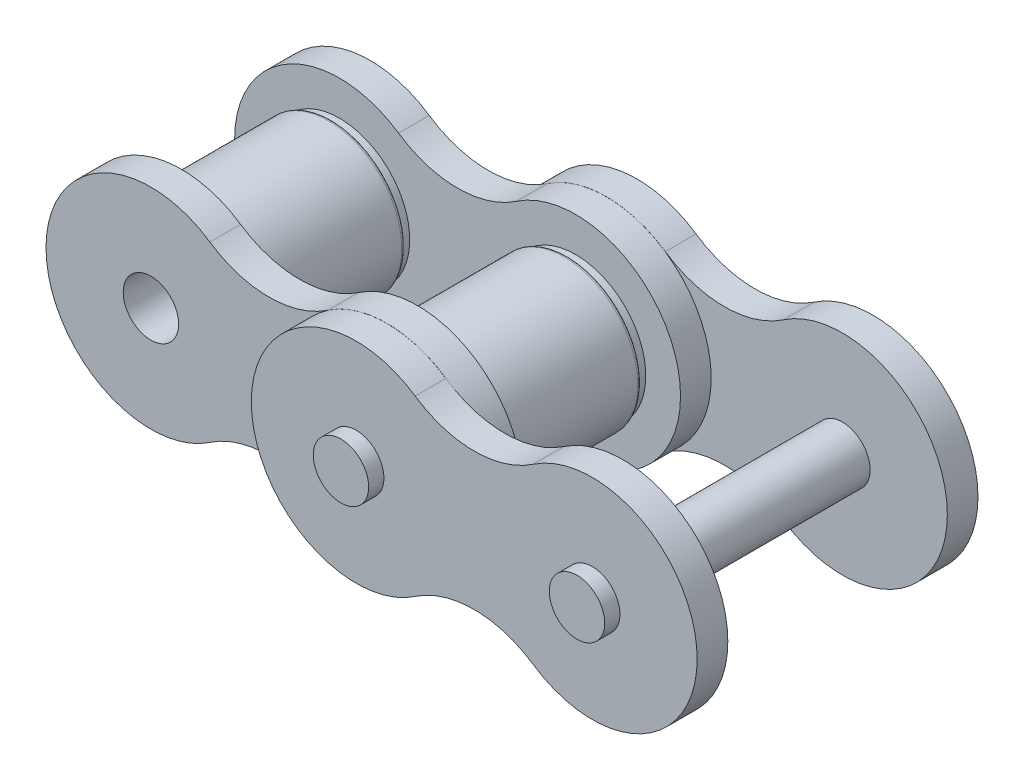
ISO-10303-21;
HEADER;
FILE_DESCRIPTION(('STEP AP214'),'2;1');
FILE_NAME('part.step','',(''),(''),'','','');
FILE_SCHEMA(('AUTOMOTIVE_DESIGN { 1 0 10303 214 1 1 1 1 }'));
ENDSEC;
DATA;
#1=APPLICATION_CONTEXT('core data for automotive mechanical design processes');
#2=APPLICATION_PROTOCOL_DEFINITION('international standard','automotive_design',2000,#1);
#3=PRODUCT_CONTEXT('',#1,'mechanical');
#4=PRODUCT('Part','Part','',(#3));
#5=PRODUCT_RELATED_PRODUCT_CATEGORY('part','',(#4));
#6=PRODUCT_DEFINITION_FORMATION('','',#4);
#7=PRODUCT_DEFINITION_CONTEXT('part definition',#1,'design');
#8=PRODUCT_DEFINITION('design','',#6,#7);
#9=PRODUCT_DEFINITION_SHAPE('','',#8);
#10=(LENGTH_UNIT() NAMED_UNIT(*) SI_UNIT(.MILLI.,.METRE.));
#11=(NAMED_UNIT(*) PLANE_ANGLE_UNIT() SI_UNIT($,.RADIAN.));
#12=(NAMED_UNIT(*) SI_UNIT($,.STERADIAN.) SOLID_ANGLE_UNIT());
#13=UNCERTAINTY_MEASURE_WITH_UNIT(LENGTH_MEASURE(1.E-05),#10,'distance_accuracy_value','');
#14=(GEOMETRIC_REPRESENTATION_CONTEXT(3) GLOBAL_UNCERTAINTY_ASSIGNED_CONTEXT((#13)) GLOBAL_UNIT_ASSIGNED_CONTEXT((#10,
#11,#12)) REPRESENTATION_CONTEXT('',''));
#15=CARTESIAN_POINT('',(0.,0.,0.));
#16=DIRECTION('',(0.,0.,1.));
#17=DIRECTION('',(1.,0.,0.));
#18=AXIS2_PLACEMENT_3D('',#15,#16,#17);
#19=CARTESIAN_POINT('',(25.4,0.,-7.24999999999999));
#20=DIRECTION('',(0.,0.,1.));
#21=DIRECTION('',(-1.,0.,0.));
#22=AXIS2_PLACEMENT_3D('',#19,#20,#21);
#23=TOROIDAL_SURFACE('',#22,7.54999999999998,0.400000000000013);
#24=CARTESIAN_POINT('',(25.4,0.,-7.65));
#25=DIRECTION('',(0.,0.,-1.));
#26=DIRECTION('',(-1.,0.,0.));
#27=AXIS2_PLACEMENT_3D('',#24,#25,#26);
#28=CIRCLE('',#27,7.55);
#29=CARTESIAN_POINT('',(17.85,0.,-7.65));
#30=VERTEX_POINT('',#29);
#31=EDGE_CURVE('E178',#30,#30,#28,.T.);
#32=ORIENTED_EDGE('',*,*,#31,.F.);
#33=EDGE_LOOP('',(#32));
#34=FACE_BOUND('',#33,.T.);
#35=CARTESIAN_POINT('',(25.4,0.,-7.25));
#36=DIRECTION('',(0.,0.,-1.));
#37=DIRECTION('',(-1.,0.,0.));
#38=AXIS2_PLACEMENT_3D('',#35,#36,#37);
#39=CIRCLE('',#38,7.95);
#40=CARTESIAN_POINT('',(17.45,0.,-7.25));
#41=VERTEX_POINT('',#40);
#42=EDGE_CURVE('E175',#41,#41,#39,.F.);
#43=ORIENTED_EDGE('',*,*,#42,.F.);
#44=EDGE_LOOP('',(#43));
#45=FACE_BOUND('',#44,.T.);
#46=ADVANCED_FACE('F15',(#34,#45),#23,.T.);
#47=CARTESIAN_POINT('',(0.,0.,-7.25));
#48=DIRECTION('',(0.,0.,1.));
#49=DIRECTION('',(-1.,0.,0.));
#50=AXIS2_PLACEMENT_3D('',#47,#48,#49);
#51=TOROIDAL_SURFACE('',#50,7.55,0.399999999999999);
#52=CARTESIAN_POINT('',(0.,0.,-7.65));
#53=DIRECTION('',(0.,0.,-1.));
#54=DIRECTION('',(-1.,0.,0.));
#55=AXIS2_PLACEMENT_3D('',#52,#53,#54);
#56=CIRCLE('',#55,7.55);
#57=CARTESIAN_POINT('',(-7.55,0.,-7.65));
#58=VERTEX_POINT('',#57);
#59=EDGE_CURVE('E181',#58,#58,#56,.T.);
#60=ORIENTED_EDGE('',*,*,#59,.F.);
#61=EDGE_LOOP('',(#60));
#62=FACE_BOUND('',#61,.T.);
#63=CARTESIAN_POINT('',(0.,0.,-7.25));
#64=DIRECTION('',(0.,0.,-1.));
#65=DIRECTION('',(-1.,0.,0.));
#66=AXIS2_PLACEMENT_3D('',#63,#64,#65);
#67=CIRCLE('',#66,7.95);
#68=CARTESIAN_POINT('',(-7.95,0.,-7.25));
#69=VERTEX_POINT('',#68);
#70=EDGE_CURVE('E172',#69,#69,#67,.F.);
#71=ORIENTED_EDGE('',*,*,#70,.F.);
#72=EDGE_LOOP('',(#71));
#73=FACE_BOUND('',#72,.T.);
#74=ADVANCED_FACE('F715',(#62,#73),#51,.T.);
#75=CARTESIAN_POINT('',(0.,0.,-8.075));
#76=DIRECTION('',(0.,0.,-1.));
#77=DIRECTION('',(-1.,0.,0.));
#78=AXIS2_PLACEMENT_3D('',#75,#76,#77);
#79=CYLINDRICAL_SURFACE('',#78,7.55);
#80=CARTESIAN_POINT('',(0.,0.,-8.5));
#81=DIRECTION('',(0.,0.,-1.));
#82=DIRECTION('',(-1.,0.,0.));
#83=AXIS2_PLACEMENT_3D('',#80,#81,#82);
#84=CIRCLE('',#83,7.55);
#85=CARTESIAN_POINT('',(-7.55,0.,-8.5));
#86=VERTEX_POINT('',#85);
#87=EDGE_CURVE('E19',#86,#86,#84,.F.);
#88=ORIENTED_EDGE('',*,*,#87,.T.);
#89=EDGE_LOOP('',(#88));
#90=FACE_BOUND('',#89,.T.);
#91=ORIENTED_EDGE('',*,*,#59,.T.);
#92=EDGE_LOOP('',(#91));
#93=FACE_BOUND('',#92,.T.);
#94=ADVANCED_FACE('F317',(#90,#93),#79,.T.);
#95=CARTESIAN_POINT('',(25.4,0.,-8.075));
#96=DIRECTION('',(0.,0.,-1.));
#97=DIRECTION('',(-1.,0.,0.));
#98=AXIS2_PLACEMENT_3D('',#95,#96,#97);
#99=CYLINDRICAL_SURFACE('',#98,7.55);
#100=ORIENTED_EDGE('',*,*,#31,.T.);
#101=EDGE_LOOP('',(#100));
#102=FACE_BOUND('',#101,.T.);
#103=CARTESIAN_POINT('',(25.4,0.,-8.5));
#104=DIRECTION('',(0.,0.,-1.));
#105=DIRECTION('',(-1.,0.,0.));
#106=AXIS2_PLACEMENT_3D('',#103,#104,#105);
#107=CIRCLE('',#106,7.55);
#108=CARTESIAN_POINT('',(17.85,0.,-8.5));
#109=VERTEX_POINT('',#108);
#110=EDGE_CURVE('E171',#109,#109,#107,.F.);
#111=ORIENTED_EDGE('',*,*,#110,.T.);
#112=EDGE_LOOP('',(#111));
#113=FACE_BOUND('',#112,.T.);
#114=ADVANCED_FACE('F700',(#102,#113),#99,.T.);
#115=CARTESIAN_POINT('',(25.4,0.,0.));
#116=DIRECTION('',(0.,0.,-1.));
#117=DIRECTION('',(-1.,0.,0.));
#118=AXIS2_PLACEMENT_3D('',#115,#116,#117);
#119=CYLINDRICAL_SURFACE('',#118,7.95);
#120=CARTESIAN_POINT('',(25.4,0.,7.24999999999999));
#121=DIRECTION('',(0.,0.,1.));
#122=DIRECTION('',(-1.,0.,0.));
#123=AXIS2_PLACEMENT_3D('',#120,#121,#122);
#124=CIRCLE('',#123,7.94999999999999);
#125=CARTESIAN_POINT('',(17.45,0.,7.24999999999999));
#126=VERTEX_POINT('',#125);
#127=EDGE_CURVE('E168',#126,#126,#124,.T.);
#128=ORIENTED_EDGE('',*,*,#127,.F.);
#129=EDGE_LOOP('',(#128));
#130=FACE_BOUND('',#129,.T.);
#131=ORIENTED_EDGE('',*,*,#42,.T.);
#132=EDGE_LOOP('',(#131));
#133=FACE_BOUND('',#132,.T.);
#134=ADVANCED_FACE('F692',(#130,#133),#119,.T.);
#135=CARTESIAN_POINT('',(0.,0.,0.));
#136=DIRECTION('',(0.,0.,-1.));
#137=DIRECTION('',(-1.,0.,0.));
#138=AXIS2_PLACEMENT_3D('',#135,#136,#137);
#139=CYLINDRICAL_SURFACE('',#138,7.95);
#140=CARTESIAN_POINT('',(0.,0.,7.25));
#141=DIRECTION('',(0.,0.,1.));
#142=DIRECTION('',(-1.,0.,0.));
#143=AXIS2_PLACEMENT_3D('',#140,#141,#142);
#144=CIRCLE('',#143,7.95);
#145=CARTESIAN_POINT('',(-7.95,0.,7.25));
#146=VERTEX_POINT('',#145);
#147=EDGE_CURVE('E164',#146,#146,#144,.T.);
#148=ORIENTED_EDGE('',*,*,#147,.F.);
#149=EDGE_LOOP('',(#148));
#150=FACE_BOUND('',#149,.T.);
#151=ORIENTED_EDGE('',*,*,#70,.T.);
#152=EDGE_LOOP('',(#151));
#153=FACE_BOUND('',#152,.T.);
#154=ADVANCED_FACE('F684',(#150,#153),#139,.T.);
#155=CARTESIAN_POINT('',(52.290625,0.,-16.75));
#156=DIRECTION('',(0.,0.,-1.));
#157=DIRECTION('',(-1.,0.,0.));
#158=AXIS2_PLACEMENT_3D('',#155,#156,#157);
#159=PLANE('',#158);
#160=CARTESIAN_POINT('',(50.8,0.,-16.75));
#161=DIRECTION('',(0.,0.,-1.));
#162=DIRECTION('',(-1.,0.,0.));
#163=AXIS2_PLACEMENT_3D('',#160,#161,#162);
#164=CIRCLE('',#163,2.98125);
#165=CARTESIAN_POINT('',(47.81875,0.,-16.75));
#166=VERTEX_POINT('',#165);
#167=EDGE_CURVE('E167',#166,#166,#164,.F.);
#168=ORIENTED_EDGE('',*,*,#167,.F.);
#169=EDGE_LOOP('',(#168));
#170=FACE_BOUND('',#169,.T.);
#171=ADVANCED_FACE('F332',(#170),#159,.T.);
#172=CARTESIAN_POINT('',(26.890625,0.,-16.75));
#173=DIRECTION('',(0.,0.,-1.));
#174=DIRECTION('',(-1.,0.,0.));
#175=AXIS2_PLACEMENT_3D('',#172,#173,#174);
#176=PLANE('',#175);
#177=CARTESIAN_POINT('',(25.4,0.,-16.75));
#178=DIRECTION('',(0.,0.,-1.));
#179=DIRECTION('',(-1.,0.,0.));
#180=AXIS2_PLACEMENT_3D('',#177,#178,#179);
#181=CIRCLE('',#180,2.98125);
#182=CARTESIAN_POINT('',(22.41875,0.,-16.75));
#183=VERTEX_POINT('',#182);
#184=EDGE_CURVE('E147',#183,#183,#181,.F.);
#185=ORIENTED_EDGE('',*,*,#184,.F.);
#186=EDGE_LOOP('',(#185));
#187=FACE_BOUND('',#186,.T.);
#188=ADVANCED_FACE('F321',(#187),#176,.T.);
#189=CARTESIAN_POINT('',(0.,0.,-8.5));
#190=DIRECTION('',(0.,0.,-1.));
#191=DIRECTION('',(-1.,0.,0.));
#192=AXIS2_PLACEMENT_3D('',#189,#190,#191);
#193=PLANE('',#192);
#194=ORIENTED_EDGE('',*,*,#110,.F.);
#195=EDGE_LOOP('',(#194));
#196=FACE_BOUND('',#195,.T.);
#197=CARTESIAN_POINT('',(12.7,-18.6675141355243,-8.5));
#198=DIRECTION('',(0.,0.,1.));
#199=DIRECTION('',(1.,0.,0.));
#200=AXIS2_PLACEMENT_3D('',#197,#198,#199);
#201=CIRCLE('',#200,11.289);
#202=CARTESIAN_POINT('',(6.35,-9.33375706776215,-8.5));
#203=VERTEX_POINT('',#202);
#204=CARTESIAN_POINT('',(19.05,-9.33375706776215,-8.5));
#205=VERTEX_POINT('',#204);
#206=EDGE_CURVE('E131',#203,#205,#201,.F.);
#207=ORIENTED_EDGE('',*,*,#206,.T.);
#208=CARTESIAN_POINT('',(25.4,0.,-8.5));
#209=DIRECTION('',(0.,0.,1.));
#210=DIRECTION('',(1.,0.,0.));
#211=AXIS2_PLACEMENT_3D('',#208,#209,#210);
#212=CIRCLE('',#211,11.289);
#213=CARTESIAN_POINT('',(19.05,9.33375706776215,-8.5));
#214=VERTEX_POINT('',#213);
#215=EDGE_CURVE('E304',#214,#205,#212,.F.);
#216=ORIENTED_EDGE('',*,*,#215,.F.);
#217=CARTESIAN_POINT('',(12.7,18.6675141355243,-8.5));
#218=DIRECTION('',(0.,0.,1.));
#219=DIRECTION('',(1.,0.,0.));
#220=AXIS2_PLACEMENT_3D('',#217,#218,#219);
#221=CIRCLE('',#220,11.289);
#222=CARTESIAN_POINT('',(6.34999999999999,9.33375706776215,-8.5));
#223=VERTEX_POINT('',#222);
#224=EDGE_CURVE('E134',#214,#223,#221,.F.);
#225=ORIENTED_EDGE('',*,*,#224,.T.);
#226=CARTESIAN_POINT('',(0.,0.,-8.5));
#227=DIRECTION('',(0.,0.,1.));
#228=DIRECTION('',(1.,0.,0.));
#229=AXIS2_PLACEMENT_3D('',#226,#227,#228);
#230=CIRCLE('',#229,11.289);
#231=EDGE_CURVE('E127',#203,#223,#230,.F.);
#232=ORIENTED_EDGE('',*,*,#231,.F.);
#233=EDGE_LOOP('',(#207,#216,#225,#232));
#234=FACE_BOUND('',#233,.T.);
#235=ORIENTED_EDGE('',*,*,#87,.F.);
#236=EDGE_LOOP('',(#235));
#237=FACE_BOUND('',#236,.T.);
#238=ADVANCED_FACE('F129',(#196,#234,#237),#193,.F.);
#239=CARTESIAN_POINT('',(25.4,0.,7.24999999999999));
#240=DIRECTION('',(0.,0.,1.));
#241=DIRECTION('',(-1.,0.,0.));
#242=AXIS2_PLACEMENT_3D('',#239,#240,#241);
#243=TOROIDAL_SURFACE('',#242,7.54999999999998,0.400000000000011);
#244=ORIENTED_EDGE('',*,*,#127,.T.);
#245=EDGE_LOOP('',(#244));
#246=FACE_BOUND('',#245,.T.);
#247=CARTESIAN_POINT('',(25.4,0.,7.65));
#248=DIRECTION('',(0.,0.,-1.));
#249=DIRECTION('',(-1.,0.,0.));
#250=AXIS2_PLACEMENT_3D('',#247,#248,#249);
#251=CIRCLE('',#250,7.54999999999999);
#252=CARTESIAN_POINT('',(17.85,0.,7.65));
#253=VERTEX_POINT('',#252);
#254=EDGE_CURVE('E161',#253,#253,#251,.F.);
#255=ORIENTED_EDGE('',*,*,#254,.F.);
#256=EDGE_LOOP('',(#255));
#257=FACE_BOUND('',#256,.T.);
#258=ADVANCED_FACE('F320',(#246,#257),#243,.T.);
#259=CARTESIAN_POINT('',(0.,0.,7.25));
#260=DIRECTION('',(0.,0.,1.));
#261=DIRECTION('',(-1.,0.,0.));
#262=AXIS2_PLACEMENT_3D('',#259,#260,#261);
#263=TOROIDAL_SURFACE('',#262,7.55,0.399999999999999);
#264=ORIENTED_EDGE('',*,*,#147,.T.);
#265=EDGE_LOOP('',(#264));
#266=FACE_BOUND('',#265,.T.);
#267=CARTESIAN_POINT('',(0.,0.,7.65));
#268=DIRECTION('',(0.,0.,-1.));
#269=DIRECTION('',(-1.,0.,0.));
#270=AXIS2_PLACEMENT_3D('',#267,#268,#269);
#271=CIRCLE('',#270,7.55);
#272=CARTESIAN_POINT('',(-7.55,0.,7.65));
#273=VERTEX_POINT('',#272);
#274=EDGE_CURVE('E157',#273,#273,#271,.F.);
#275=ORIENTED_EDGE('',*,*,#274,.F.);
#276=EDGE_LOOP('',(#275));
#277=FACE_BOUND('',#276,.T.);
#278=ADVANCED_FACE('F329',(#266,#277),#263,.T.);
#279=CARTESIAN_POINT('',(50.8,0.,0.));
#280=DIRECTION('',(0.,0.,-1.));
#281=DIRECTION('',(-1.,0.,0.));
#282=AXIS2_PLACEMENT_3D('',#279,#280,#281);
#283=CYLINDRICAL_SURFACE('',#282,2.98125);
#284=ORIENTED_EDGE('',*,*,#167,.T.);
#285=EDGE_LOOP('',(#284));
#286=FACE_BOUND('',#285,.T.);
#287=CARTESIAN_POINT('',(50.8,0.,-15.11));
#288=DIRECTION('',(0.,0.,-1.));
#289=DIRECTION('',(-1.,0.,0.));
#290=AXIS2_PLACEMENT_3D('',#287,#288,#289);
#291=CIRCLE('',#290,2.98125);
#292=CARTESIAN_POINT('',(47.81875,0.,-15.11));
#293=VERTEX_POINT('',#292);
#294=EDGE_CURVE('E160',#293,#293,#291,.F.);
#295=ORIENTED_EDGE('',*,*,#294,.F.);
#296=EDGE_LOOP('',(#295));
#297=FACE_BOUND('',#296,.T.);
#298=ADVANCED_FACE('F652',(#286,#297),#283,.T.);
#299=CARTESIAN_POINT('',(25.4,0.,-12.625));
#300=DIRECTION('',(0.,0.,-1.));
#301=DIRECTION('',(-1.,0.,0.));
#302=AXIS2_PLACEMENT_3D('',#299,#300,#301);
#303=CYLINDRICAL_SURFACE('',#302,2.98125);
#304=CARTESIAN_POINT('',(25.4,0.,-15.11));
#305=DIRECTION('',(0.,0.,-1.));
#306=DIRECTION('',(-1.,0.,0.));
#307=AXIS2_PLACEMENT_3D('',#304,#305,#306);
#308=CIRCLE('',#307,2.98125);
#309=CARTESIAN_POINT('',(22.41875,0.,-15.11));
#310=VERTEX_POINT('',#309);
#311=EDGE_CURVE('E299',#310,#310,#308,.F.);
#312=ORIENTED_EDGE('',*,*,#311,.F.);
#313=EDGE_LOOP('',(#312));
#314=FACE_BOUND('',#313,.T.);
#315=ORIENTED_EDGE('',*,*,#184,.T.);
#316=EDGE_LOOP('',(#315));
#317=FACE_BOUND('',#316,.T.);
#318=ADVANCED_FACE('F645',(#314,#317),#303,.T.);
#319=CARTESIAN_POINT('',(12.7,-18.6675141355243,-8.5));
#320=DIRECTION('',(0.,0.,1.));
#321=DIRECTION('',(1.,0.,0.));
#322=AXIS2_PLACEMENT_3D('',#319,#320,#321);
#323=CYLINDRICAL_SURFACE('',#322,11.289);
#324=DIRECTION('',(0.,0.,1.));
#325=VECTOR('',#324,1.);
#326=CARTESIAN_POINT('',(19.05,-9.33375706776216,-8.5));
#327=LINE('',#326,#325);
#328=CARTESIAN_POINT('',(19.05,-9.33375706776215,-11.8));
#329=VERTEX_POINT('',#328);
#330=EDGE_CURVE('E145',#205,#329,#327,.F.);
#331=ORIENTED_EDGE('',*,*,#330,.F.);
#332=ORIENTED_EDGE('',*,*,#206,.F.);
#333=DIRECTION('',(0.,0.,1.));
#334=VECTOR('',#333,1.);
#335=CARTESIAN_POINT('',(6.34999999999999,-9.33375706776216,-8.5));
#336=LINE('',#335,#334);
#337=CARTESIAN_POINT('',(6.35,-9.33375706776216,-11.8));
#338=VERTEX_POINT('',#337);
#339=EDGE_CURVE('E138',#338,#203,#336,.T.);
#340=ORIENTED_EDGE('',*,*,#339,.F.);
#341=CARTESIAN_POINT('',(12.7,-18.6675141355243,-11.8));
#342=DIRECTION('',(0.,0.,1.));
#343=DIRECTION('',(1.,0.,0.));
#344=AXIS2_PLACEMENT_3D('',#341,#342,#343);
#345=CIRCLE('',#344,11.289);
#346=EDGE_CURVE('E297',#329,#338,#345,.T.);
#347=ORIENTED_EDGE('',*,*,#346,.F.);
#348=EDGE_LOOP('',(#331,#332,#340,#347));
#349=FACE_BOUND('',#348,.T.);
#350=ADVANCED_FACE('F142',(#349),#323,.F.);
#351=CARTESIAN_POINT('',(0.,0.,-8.5));
#352=DIRECTION('',(0.,0.,1.));
#353=DIRECTION('',(1.,0.,0.));
#354=AXIS2_PLACEMENT_3D('',#351,#352,#353);
#355=CYLINDRICAL_SURFACE('',#354,11.289);
#356=DIRECTION('',(0.,0.,1.));
#357=VECTOR('',#356,1.);
#358=CARTESIAN_POINT('',(6.34999999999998,9.33375706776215,-8.5));
#359=LINE('',#358,#357);
#360=CARTESIAN_POINT('',(6.34999999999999,9.33375706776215,-11.8));
#361=VERTEX_POINT('',#360);
#362=EDGE_CURVE('E155',#223,#361,#359,.F.);
#363=ORIENTED_EDGE('',*,*,#362,.T.);
#364=CARTESIAN_POINT('',(0.,0.,-11.8));
#365=DIRECTION('',(0.,0.,1.));
#366=DIRECTION('',(1.,0.,0.));
#367=AXIS2_PLACEMENT_3D('',#364,#365,#366);
#368=CIRCLE('',#367,11.289);
#369=EDGE_CURVE('E151',#338,#361,#368,.F.);
#370=ORIENTED_EDGE('',*,*,#369,.F.);
#371=ORIENTED_EDGE('',*,*,#339,.T.);
#372=ORIENTED_EDGE('',*,*,#231,.T.);
#373=EDGE_LOOP('',(#363,#370,#371,#372));
#374=FACE_BOUND('',#373,.T.);
#375=ADVANCED_FACE('F149',(#374),#355,.T.);
#376=CARTESIAN_POINT('',(12.7,18.6675141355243,-8.5));
#377=DIRECTION('',(0.,0.,1.));
#378=DIRECTION('',(1.,0.,0.));
#379=AXIS2_PLACEMENT_3D('',#376,#377,#378);
#380=CYLINDRICAL_SURFACE('',#379,11.289);
#381=ORIENTED_EDGE('',*,*,#362,.F.);
#382=ORIENTED_EDGE('',*,*,#224,.F.);
#383=DIRECTION('',(0.,0.,1.));
#384=VECTOR('',#383,1.);
#385=CARTESIAN_POINT('',(19.05,9.33375706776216,-8.5));
#386=LINE('',#385,#384);
#387=CARTESIAN_POINT('',(19.05,9.33375706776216,-11.8));
#388=VERTEX_POINT('',#387);
#389=EDGE_CURVE('E306',#388,#214,#386,.T.);
#390=ORIENTED_EDGE('',*,*,#389,.F.);
#391=CARTESIAN_POINT('',(12.7,18.6675141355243,-11.8));
#392=DIRECTION('',(0.,0.,1.));
#393=DIRECTION('',(1.,0.,0.));
#394=AXIS2_PLACEMENT_3D('',#391,#392,#393);
#395=CIRCLE('',#394,11.289);
#396=EDGE_CURVE('E293',#361,#388,#395,.T.);
#397=ORIENTED_EDGE('',*,*,#396,.F.);
#398=EDGE_LOOP('',(#381,#382,#390,#397));
#399=FACE_BOUND('',#398,.T.);
#400=ADVANCED_FACE('F415',(#399),#380,.F.);
#401=CARTESIAN_POINT('',(25.4,0.,-8.5));
#402=DIRECTION('',(0.,0.,1.));
#403=DIRECTION('',(1.,0.,0.));
#404=AXIS2_PLACEMENT_3D('',#401,#402,#403);
#405=CYLINDRICAL_SURFACE('',#404,11.289);
#406=ORIENTED_EDGE('',*,*,#330,.T.);
#407=CARTESIAN_POINT('',(25.4,0.,-11.8));
#408=DIRECTION('',(0.,0.,1.));
#409=DIRECTION('',(1.,0.,0.));
#410=AXIS2_PLACEMENT_3D('',#407,#408,#409);
#411=CIRCLE('',#410,11.289);
#412=EDGE_CURVE('E290',#388,#329,#411,.F.);
#413=ORIENTED_EDGE('',*,*,#412,.F.);
#414=ORIENTED_EDGE('',*,*,#389,.T.);
#415=ORIENTED_EDGE('',*,*,#215,.T.);
#416=EDGE_LOOP('',(#406,#413,#414,#415));
#417=FACE_BOUND('',#416,.T.);
#418=ADVANCED_FACE('F419',(#417),#405,.T.);
#419=CARTESIAN_POINT('',(25.4,0.,8.075));
#420=DIRECTION('',(0.,0.,-1.));
#421=DIRECTION('',(-1.,0.,0.));
#422=AXIS2_PLACEMENT_3D('',#419,#420,#421);
#423=CYLINDRICAL_SURFACE('',#422,7.54999999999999);
#424=CARTESIAN_POINT('',(25.4,0.,8.5));
#425=DIRECTION('',(0.,0.,-1.));
#426=DIRECTION('',(-1.,0.,0.));
#427=AXIS2_PLACEMENT_3D('',#424,#425,#426);
#428=CIRCLE('',#427,7.54999999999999);
#429=CARTESIAN_POINT('',(17.85,0.,8.5));
#430=VERTEX_POINT('',#429);
#431=EDGE_CURVE('E287',#430,#430,#428,.F.);
#432=ORIENTED_EDGE('',*,*,#431,.F.);
#433=EDGE_LOOP('',(#432));
#434=FACE_BOUND('',#433,.T.);
#435=ORIENTED_EDGE('',*,*,#254,.T.);
#436=EDGE_LOOP('',(#435));
#437=FACE_BOUND('',#436,.T.);
#438=ADVANCED_FACE('F421',(#434,#437),#423,.T.);
#439=CARTESIAN_POINT('',(0.,0.,8.075));
#440=DIRECTION('',(0.,0.,-1.));
#441=DIRECTION('',(-1.,0.,0.));
#442=AXIS2_PLACEMENT_3D('',#439,#440,#441);
#443=CYLINDRICAL_SURFACE('',#442,7.55);
#444=CARTESIAN_POINT('',(0.,0.,8.5));
#445=DIRECTION('',(0.,0.,-1.));
#446=DIRECTION('',(-1.,0.,0.));
#447=AXIS2_PLACEMENT_3D('',#444,#445,#446);
#448=CIRCLE('',#447,7.55);
#449=CARTESIAN_POINT('',(-7.55,0.,8.5));
#450=VERTEX_POINT('',#449);
#451=EDGE_CURVE('E284',#450,#450,#448,.F.);
#452=ORIENTED_EDGE('',*,*,#451,.F.);
#453=EDGE_LOOP('',(#452));
#454=FACE_BOUND('',#453,.T.);
#455=ORIENTED_EDGE('',*,*,#274,.T.);
#456=EDGE_LOOP('',(#455));
#457=FACE_BOUND('',#456,.T.);
#458=ADVANCED_FACE('F427',(#454,#457),#443,.T.);
#459=CARTESIAN_POINT('',(0.,0.,-15.11));
#460=DIRECTION('',(0.,0.,-1.));
#461=DIRECTION('',(-1.,0.,0.));
#462=AXIS2_PLACEMENT_3D('',#459,#460,#461);
#463=PLANE('',#462);
#464=ORIENTED_EDGE('',*,*,#311,.T.);
#465=EDGE_LOOP('',(#464));
#466=FACE_BOUND('',#465,.T.);
#467=CARTESIAN_POINT('',(38.1,18.6675141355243,-15.11));
#468=DIRECTION('',(0.,0.,1.));
#469=DIRECTION('',(1.,0.,0.));
#470=AXIS2_PLACEMENT_3D('',#467,#468,#469);
#471=CIRCLE('',#470,11.289);
#472=CARTESIAN_POINT('',(31.75,9.33375706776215,-15.11));
#473=VERTEX_POINT('',#472);
#474=CARTESIAN_POINT('',(44.45,9.33375706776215,-15.11));
#475=VERTEX_POINT('',#474);
#476=EDGE_CURVE('E280',#473,#475,#471,.T.);
#477=ORIENTED_EDGE('',*,*,#476,.T.);
#478=CARTESIAN_POINT('',(50.8,0.,-15.11));
#479=DIRECTION('',(0.,0.,1.));
#480=DIRECTION('',(1.,0.,0.));
#481=AXIS2_PLACEMENT_3D('',#478,#479,#480);
#482=CIRCLE('',#481,11.289);
#483=CARTESIAN_POINT('',(44.45,-9.33375706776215,-15.11));
#484=VERTEX_POINT('',#483);
#485=EDGE_CURVE('E277',#484,#475,#482,.T.);
#486=ORIENTED_EDGE('',*,*,#485,.F.);
#487=CARTESIAN_POINT('',(38.1,-18.6675141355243,-15.11));
#488=DIRECTION('',(0.,0.,1.));
#489=DIRECTION('',(1.,0.,0.));
#490=AXIS2_PLACEMENT_3D('',#487,#488,#489);
#491=CIRCLE('',#490,11.289);
#492=CARTESIAN_POINT('',(31.75,-9.33375706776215,-15.11));
#493=VERTEX_POINT('',#492);
#494=EDGE_CURVE('E274',#484,#493,#491,.T.);
#495=ORIENTED_EDGE('',*,*,#494,.T.);
#496=CARTESIAN_POINT('',(25.4,0.,-15.11));
#497=DIRECTION('',(0.,0.,1.));
#498=DIRECTION('',(1.,0.,0.));
#499=AXIS2_PLACEMENT_3D('',#496,#497,#498);
#500=CIRCLE('',#499,11.289);
#501=EDGE_CURVE('E271',#473,#493,#500,.T.);
#502=ORIENTED_EDGE('',*,*,#501,.F.);
#503=EDGE_LOOP('',(#477,#486,#495,#502));
#504=FACE_BOUND('',#503,.T.);
#505=ORIENTED_EDGE('',*,*,#294,.T.);
#506=EDGE_LOOP('',(#505));
#507=FACE_BOUND('',#506,.T.);
#508=ADVANCED_FACE('F435',(#466,#504,#507),#463,.T.);
#509=CARTESIAN_POINT('',(52.290625,0.,16.75));
#510=DIRECTION('',(0.,0.,1.));
#511=DIRECTION('',(1.,0.,0.));
#512=AXIS2_PLACEMENT_3D('',#509,#510,#511);
#513=PLANE('',#512);
#514=CARTESIAN_POINT('',(50.8,0.,16.75));
#515=DIRECTION('',(0.,0.,-1.));
#516=DIRECTION('',(-1.,0.,0.));
#517=AXIS2_PLACEMENT_3D('',#514,#515,#516);
#518=CIRCLE('',#517,2.98125);
#519=CARTESIAN_POINT('',(47.81875,0.,16.75));
#520=VERTEX_POINT('',#519);
#521=EDGE_CURVE('E264',#520,#520,#518,.T.);
#522=ORIENTED_EDGE('',*,*,#521,.F.);
#523=EDGE_LOOP('',(#522));
#524=FACE_BOUND('',#523,.T.);
#525=ADVANCED_FACE('F439',(#524),#513,.T.);
#526=CARTESIAN_POINT('',(26.890625,0.,16.75));
#527=DIRECTION('',(0.,0.,1.));
#528=DIRECTION('',(1.,0.,0.));
#529=AXIS2_PLACEMENT_3D('',#526,#527,#528);
#530=PLANE('',#529);
#531=CARTESIAN_POINT('',(25.4,0.,16.75));
#532=DIRECTION('',(0.,0.,-1.));
#533=DIRECTION('',(-1.,0.,0.));
#534=AXIS2_PLACEMENT_3D('',#531,#532,#533);
#535=CIRCLE('',#534,2.98125);
#536=CARTESIAN_POINT('',(22.41875,0.,16.75));
#537=VERTEX_POINT('',#536);
#538=EDGE_CURVE('E261',#537,#537,#535,.T.);
#539=ORIENTED_EDGE('',*,*,#538,.F.);
#540=EDGE_LOOP('',(#539));
#541=FACE_BOUND('',#540,.T.);
#542=ADVANCED_FACE('F443',(#541),#530,.T.);
#543=CARTESIAN_POINT('',(0.,0.,-11.8));
#544=DIRECTION('',(0.,0.,-1.));
#545=DIRECTION('',(-1.,0.,0.));
#546=AXIS2_PLACEMENT_3D('',#543,#544,#545);
#547=PLANE('',#546);
#548=ORIENTED_EDGE('',*,*,#396,.T.);
#549=ORIENTED_EDGE('',*,*,#412,.T.);
#550=ORIENTED_EDGE('',*,*,#346,.T.);
#551=ORIENTED_EDGE('',*,*,#369,.T.);
#552=EDGE_LOOP('',(#548,#549,#550,#551));
#553=FACE_BOUND('',#552,.T.);
#554=CARTESIAN_POINT('',(25.4,0.,-11.8));
#555=DIRECTION('',(0.,0.,-1.));
#556=DIRECTION('',(-1.,0.,0.));
#557=AXIS2_PLACEMENT_3D('',#554,#555,#556);
#558=CIRCLE('',#557,2.98125);
#559=CARTESIAN_POINT('',(22.41875,0.,-11.8));
#560=VERTEX_POINT('',#559);
#561=EDGE_CURVE('E267',#560,#560,#558,.T.);
#562=ORIENTED_EDGE('',*,*,#561,.F.);
#563=EDGE_LOOP('',(#562));
#564=FACE_BOUND('',#563,.T.);
#565=CARTESIAN_POINT('',(0.,0.,-11.8));
#566=DIRECTION('',(0.,0.,-1.));
#567=DIRECTION('',(-1.,0.,0.));
#568=AXIS2_PLACEMENT_3D('',#565,#566,#567);
#569=CIRCLE('',#568,2.98125);
#570=CARTESIAN_POINT('',(-2.98125,0.,-11.8));
#571=VERTEX_POINT('',#570);
#572=EDGE_CURVE('E258',#571,#571,#569,.F.);
#573=ORIENTED_EDGE('',*,*,#572,.T.);
#574=EDGE_LOOP('',(#573));
#575=FACE_BOUND('',#574,.T.);
#576=ADVANCED_FACE('F417',(#553,#564,#575),#547,.T.);
#577=CARTESIAN_POINT('',(0.,0.,8.5));
#578=DIRECTION('',(0.,0.,-1.));
#579=DIRECTION('',(-1.,0.,0.));
#580=AXIS2_PLACEMENT_3D('',#577,#578,#579);
#581=PLANE('',#580);
#582=ORIENTED_EDGE('',*,*,#451,.T.);
#583=EDGE_LOOP('',(#582));
#584=FACE_BOUND('',#583,.T.);
#585=CARTESIAN_POINT('',(25.4,0.,8.5));
#586=DIRECTION('',(0.,0.,-1.));
#587=DIRECTION('',(-1.,0.,0.));
#588=AXIS2_PLACEMENT_3D('',#585,#586,#587);
#589=CIRCLE('',#588,11.289);
#590=CARTESIAN_POINT('',(19.05,-9.33375706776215,8.5));
#591=VERTEX_POINT('',#590);
#592=CARTESIAN_POINT('',(19.05,9.33375706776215,8.5));
#593=VERTEX_POINT('',#592);
#594=EDGE_CURVE('E256',#591,#593,#589,.F.);
#595=ORIENTED_EDGE('',*,*,#594,.F.);
#596=CARTESIAN_POINT('',(12.7,-18.6675141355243,8.5));
#597=DIRECTION('',(0.,0.,-1.));
#598=DIRECTION('',(-1.,0.,0.));
#599=AXIS2_PLACEMENT_3D('',#596,#597,#598);
#600=CIRCLE('',#599,11.289);
#601=CARTESIAN_POINT('',(6.35,-9.33375706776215,8.5));
#602=VERTEX_POINT('',#601);
#603=EDGE_CURVE('E252',#591,#602,#600,.F.);
#604=ORIENTED_EDGE('',*,*,#603,.T.);
#605=CARTESIAN_POINT('',(0.,0.,8.5));
#606=DIRECTION('',(0.,0.,-1.));
#607=DIRECTION('',(-1.,0.,0.));
#608=AXIS2_PLACEMENT_3D('',#605,#606,#607);
#609=CIRCLE('',#608,11.289);
#610=CARTESIAN_POINT('',(6.34999999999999,9.33375706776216,8.5));
#611=VERTEX_POINT('',#610);
#612=EDGE_CURVE('E249',#611,#602,#609,.F.);
#613=ORIENTED_EDGE('',*,*,#612,.F.);
#614=CARTESIAN_POINT('',(12.7,18.6675141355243,8.5));
#615=DIRECTION('',(0.,0.,-1.));
#616=DIRECTION('',(-1.,0.,0.));
#617=AXIS2_PLACEMENT_3D('',#614,#615,#616);
#618=CIRCLE('',#617,11.289);
#619=EDGE_CURVE('E245',#611,#593,#618,.F.);
#620=ORIENTED_EDGE('',*,*,#619,.T.);
#621=EDGE_LOOP('',(#595,#604,#613,#620));
#622=FACE_BOUND('',#621,.T.);
#623=ORIENTED_EDGE('',*,*,#431,.T.);
#624=EDGE_LOOP('',(#623));
#625=FACE_BOUND('',#624,.T.);
#626=ADVANCED_FACE('F450',(#584,#622,#625),#581,.T.);
#627=CARTESIAN_POINT('',(38.1,18.6675141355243,-11.81));
#628=DIRECTION('',(0.,0.,1.));
#629=DIRECTION('',(1.,0.,0.));
#630=AXIS2_PLACEMENT_3D('',#627,#628,#629);
#631=CYLINDRICAL_SURFACE('',#630,11.289);
#632=DIRECTION('',(0.,0.,1.));
#633=VECTOR('',#632,1.);
#634=CARTESIAN_POINT('',(31.75,9.33375706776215,-11.81));
#635=LINE('',#634,#633);
#636=CARTESIAN_POINT('',(31.75,9.33375706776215,-11.81));
#637=VERTEX_POINT('',#636);
#638=EDGE_CURVE('E283',#637,#473,#635,.F.);
#639=ORIENTED_EDGE('',*,*,#638,.F.);
#640=CARTESIAN_POINT('',(38.1,18.6675141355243,-11.81));
#641=DIRECTION('',(0.,0.,1.));
#642=DIRECTION('',(1.,0.,0.));
#643=AXIS2_PLACEMENT_3D('',#640,#641,#642);
#644=CIRCLE('',#643,11.289);
#645=CARTESIAN_POINT('',(44.45,9.33375706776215,-11.81));
#646=VERTEX_POINT('',#645);
#647=EDGE_CURVE('E241',#637,#646,#644,.T.);
#648=ORIENTED_EDGE('',*,*,#647,.T.);
#649=DIRECTION('',(0.,0.,1.));
#650=VECTOR('',#649,1.);
#651=CARTESIAN_POINT('',(44.45,9.33375706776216,-11.81));
#652=LINE('',#651,#650);
#653=EDGE_CURVE('E279',#475,#646,#652,.T.);
#654=ORIENTED_EDGE('',*,*,#653,.F.);
#655=ORIENTED_EDGE('',*,*,#476,.F.);
#656=EDGE_LOOP('',(#639,#648,#654,#655));
#657=FACE_BOUND('',#656,.T.);
#658=ADVANCED_FACE('F453',(#657),#631,.F.);
#659=CARTESIAN_POINT('',(50.8,0.,-11.81));
#660=DIRECTION('',(0.,0.,1.));
#661=DIRECTION('',(1.,0.,0.));
#662=AXIS2_PLACEMENT_3D('',#659,#660,#661);
#663=CYLINDRICAL_SURFACE('',#662,11.289);
#664=DIRECTION('',(0.,0.,1.));
#665=VECTOR('',#664,1.);
#666=CARTESIAN_POINT('',(44.45,-9.33375706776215,-11.81));
#667=LINE('',#666,#665);
#668=CARTESIAN_POINT('',(44.45,-9.33375706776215,-11.81));
#669=VERTEX_POINT('',#668);
#670=EDGE_CURVE('E276',#669,#484,#667,.F.);
#671=ORIENTED_EDGE('',*,*,#670,.T.);
#672=ORIENTED_EDGE('',*,*,#485,.T.);
#673=ORIENTED_EDGE('',*,*,#653,.T.);
#674=CARTESIAN_POINT('',(50.8,0.,-11.81));
#675=DIRECTION('',(0.,0.,1.));
#676=DIRECTION('',(1.,0.,0.));
#677=AXIS2_PLACEMENT_3D('',#674,#675,#676);
#678=CIRCLE('',#677,11.289);
#679=EDGE_CURVE('E239',#646,#669,#678,.F.);
#680=ORIENTED_EDGE('',*,*,#679,.T.);
#681=EDGE_LOOP('',(#671,#672,#673,#680));
#682=FACE_BOUND('',#681,.T.);
#683=ADVANCED_FACE('F457',(#682),#663,.T.);
#684=CARTESIAN_POINT('',(38.1,-18.6675141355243,-11.81));
#685=DIRECTION('',(0.,0.,1.));
#686=DIRECTION('',(1.,0.,0.));
#687=AXIS2_PLACEMENT_3D('',#684,#685,#686);
#688=CYLINDRICAL_SURFACE('',#687,11.289);
#689=ORIENTED_EDGE('',*,*,#670,.F.);
#690=CARTESIAN_POINT('',(38.1,-18.6675141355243,-11.81));
#691=DIRECTION('',(0.,0.,1.));
#692=DIRECTION('',(1.,0.,0.));
#693=AXIS2_PLACEMENT_3D('',#690,#691,#692);
#694=CIRCLE('',#693,11.289);
#695=CARTESIAN_POINT('',(31.75,-9.33375706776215,-11.81));
#696=VERTEX_POINT('',#695);
#697=EDGE_CURVE('E237',#669,#696,#694,.T.);
#698=ORIENTED_EDGE('',*,*,#697,.T.);
#699=DIRECTION('',(0.,0.,1.));
#700=VECTOR('',#699,1.);
#701=CARTESIAN_POINT('',(31.75,-9.33375706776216,-11.81));
#702=LINE('',#701,#700);
#703=EDGE_CURVE('E270',#493,#696,#702,.T.);
#704=ORIENTED_EDGE('',*,*,#703,.F.);
#705=ORIENTED_EDGE('',*,*,#494,.F.);
#706=EDGE_LOOP('',(#689,#698,#704,#705));
#707=FACE_BOUND('',#706,.T.);
#708=ADVANCED_FACE('F461',(#707),#688,.F.);
#709=CARTESIAN_POINT('',(25.4,0.,-11.81));
#710=DIRECTION('',(0.,0.,1.));
#711=DIRECTION('',(1.,0.,0.));
#712=AXIS2_PLACEMENT_3D('',#709,#710,#711);
#713=CYLINDRICAL_SURFACE('',#712,11.289);
#714=ORIENTED_EDGE('',*,*,#703,.T.);
#715=CARTESIAN_POINT('',(25.4,0.,-11.81));
#716=DIRECTION('',(0.,0.,1.));
#717=DIRECTION('',(1.,0.,0.));
#718=AXIS2_PLACEMENT_3D('',#715,#716,#717);
#719=CIRCLE('',#718,11.289);
#720=EDGE_CURVE('E235',#696,#637,#719,.F.);
#721=ORIENTED_EDGE('',*,*,#720,.T.);
#722=ORIENTED_EDGE('',*,*,#638,.T.);
#723=ORIENTED_EDGE('',*,*,#501,.T.);
#724=EDGE_LOOP('',(#714,#721,#722,#723));
#725=FACE_BOUND('',#724,.T.);
#726=ADVANCED_FACE('F465',(#725),#713,.T.);
#727=CARTESIAN_POINT('',(25.4,0.,-12.625));
#728=DIRECTION('',(0.,0.,-1.));
#729=DIRECTION('',(-1.,0.,0.));
#730=AXIS2_PLACEMENT_3D('',#727,#728,#729);
#731=CYLINDRICAL_SURFACE('',#730,2.98125);
#732=ORIENTED_EDGE('',*,*,#561,.T.);
#733=EDGE_LOOP('',(#732));
#734=FACE_BOUND('',#733,.T.);
#735=CARTESIAN_POINT('',(25.4,0.,-11.81));
#736=DIRECTION('',(0.,0.,-1.));
#737=DIRECTION('',(-1.,0.,0.));
#738=AXIS2_PLACEMENT_3D('',#735,#736,#737);
#739=CIRCLE('',#738,2.98125);
#740=CARTESIAN_POINT('',(22.41875,0.,-11.81));
#741=VERTEX_POINT('',#740);
#742=EDGE_CURVE('E232',#741,#741,#739,.F.);
#743=ORIENTED_EDGE('',*,*,#742,.T.);
#744=EDGE_LOOP('',(#743));
#745=FACE_BOUND('',#744,.T.);
#746=ADVANCED_FACE('F469',(#734,#745),#731,.T.);
#747=CARTESIAN_POINT('',(50.8,0.,0.));
#748=DIRECTION('',(0.,0.,-1.));
#749=DIRECTION('',(-1.,0.,0.));
#750=AXIS2_PLACEMENT_3D('',#747,#748,#749);
#751=CYLINDRICAL_SURFACE('',#750,2.98125);
#752=CARTESIAN_POINT('',(50.8,0.,15.11));
#753=DIRECTION('',(0.,0.,-1.));
#754=DIRECTION('',(-1.,0.,0.));
#755=AXIS2_PLACEMENT_3D('',#752,#753,#754);
#756=CIRCLE('',#755,2.98125);
#757=CARTESIAN_POINT('',(47.81875,0.,15.11));
#758=VERTEX_POINT('',#757);
#759=EDGE_CURVE('E229',#758,#758,#756,.F.);
#760=ORIENTED_EDGE('',*,*,#759,.T.);
#761=EDGE_LOOP('',(#760));
#762=FACE_BOUND('',#761,.T.);
#763=ORIENTED_EDGE('',*,*,#521,.T.);
#764=EDGE_LOOP('',(#763));
#765=FACE_BOUND('',#764,.T.);
#766=ADVANCED_FACE('F473',(#762,#765),#751,.T.);
#767=CARTESIAN_POINT('',(25.4,0.,12.625));
#768=DIRECTION('',(0.,0.,-1.));
#769=DIRECTION('',(-1.,0.,0.));
#770=AXIS2_PLACEMENT_3D('',#767,#768,#769);
#771=CYLINDRICAL_SURFACE('',#770,2.98125);
#772=ORIENTED_EDGE('',*,*,#538,.T.);
#773=EDGE_LOOP('',(#772));
#774=FACE_BOUND('',#773,.T.);
#775=CARTESIAN_POINT('',(25.4,0.,15.11));
#776=DIRECTION('',(0.,0.,-1.));
#777=DIRECTION('',(-1.,0.,0.));
#778=AXIS2_PLACEMENT_3D('',#775,#776,#777);
#779=CIRCLE('',#778,2.98125);
#780=CARTESIAN_POINT('',(22.41875,0.,15.11));
#781=VERTEX_POINT('',#780);
#782=EDGE_CURVE('E226',#781,#781,#779,.F.);
#783=ORIENTED_EDGE('',*,*,#782,.T.);
#784=EDGE_LOOP('',(#783));
#785=FACE_BOUND('',#784,.T.);
#786=ADVANCED_FACE('F477',(#774,#785),#771,.T.);
#787=CARTESIAN_POINT('',(0.,0.,0.));
#788=DIRECTION('',(0.,0.,-1.));
#789=DIRECTION('',(-1.,0.,0.));
#790=AXIS2_PLACEMENT_3D('',#787,#788,#789);
#791=CYLINDRICAL_SURFACE('',#790,2.98125);
#792=CARTESIAN_POINT('',(0.,0.,11.8));
#793=DIRECTION('',(0.,0.,-1.));
#794=DIRECTION('',(-1.,0.,0.));
#795=AXIS2_PLACEMENT_3D('',#792,#793,#794);
#796=CIRCLE('',#795,2.98125);
#797=CARTESIAN_POINT('',(-2.98125,0.,11.8));
#798=VERTEX_POINT('',#797);
#799=EDGE_CURVE('E223',#798,#798,#796,.F.);
#800=ORIENTED_EDGE('',*,*,#799,.T.);
#801=EDGE_LOOP('',(#800));
#802=FACE_BOUND('',#801,.T.);
#803=ORIENTED_EDGE('',*,*,#572,.F.);
#804=EDGE_LOOP('',(#803));
#805=FACE_BOUND('',#804,.T.);
#806=ADVANCED_FACE('F481',(#802,#805),#791,.F.);
#807=CARTESIAN_POINT('',(25.4,0.,8.5));
#808=DIRECTION('',(0.,0.,-1.));
#809=DIRECTION('',(-1.,0.,0.));
#810=AXIS2_PLACEMENT_3D('',#807,#808,#809);
#811=CYLINDRICAL_SURFACE('',#810,11.289);
#812=DIRECTION('',(0.,0.,-1.));
#813=VECTOR('',#812,1.);
#814=CARTESIAN_POINT('',(19.05,-9.33375706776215,8.5));
#815=LINE('',#814,#813);
#816=CARTESIAN_POINT('',(19.05,-9.33375706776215,11.8));
#817=VERTEX_POINT('',#816);
#818=EDGE_CURVE('E255',#817,#591,#815,.T.);
#819=ORIENTED_EDGE('',*,*,#818,.T.);
#820=ORIENTED_EDGE('',*,*,#594,.T.);
#821=DIRECTION('',(0.,0.,-1.));
#822=VECTOR('',#821,1.);
#823=CARTESIAN_POINT('',(19.05,9.33375706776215,8.5));
#824=LINE('',#823,#822);
#825=CARTESIAN_POINT('',(19.05,9.33375706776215,11.8));
#826=VERTEX_POINT('',#825);
#827=EDGE_CURVE('E244',#593,#826,#824,.F.);
#828=ORIENTED_EDGE('',*,*,#827,.T.);
#829=CARTESIAN_POINT('',(25.4,0.,11.8));
#830=DIRECTION('',(0.,0.,-1.));
#831=DIRECTION('',(-1.,0.,0.));
#832=AXIS2_PLACEMENT_3D('',#829,#830,#831);
#833=CIRCLE('',#832,11.289);
#834=EDGE_CURVE('E221',#826,#817,#833,.T.);
#835=ORIENTED_EDGE('',*,*,#834,.T.);
#836=EDGE_LOOP('',(#819,#820,#828,#835));
#837=FACE_BOUND('',#836,.T.);
#838=ADVANCED_FACE('F485',(#837),#811,.T.);
#839=CARTESIAN_POINT('',(12.7,-18.6675141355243,8.5));
#840=DIRECTION('',(0.,0.,-1.));
#841=DIRECTION('',(-1.,0.,0.));
#842=AXIS2_PLACEMENT_3D('',#839,#840,#841);
#843=CYLINDRICAL_SURFACE('',#842,11.289);
#844=DIRECTION('',(0.,0.,-1.));
#845=VECTOR('',#844,1.);
#846=CARTESIAN_POINT('',(6.35,-9.33375706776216,8.5));
#847=LINE('',#846,#845);
#848=CARTESIAN_POINT('',(6.35,-9.33375706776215,11.8));
#849=VERTEX_POINT('',#848);
#850=EDGE_CURVE('E251',#602,#849,#847,.F.);
#851=ORIENTED_EDGE('',*,*,#850,.F.);
#852=ORIENTED_EDGE('',*,*,#603,.F.);
#853=ORIENTED_EDGE('',*,*,#818,.F.);
#854=CARTESIAN_POINT('',(12.7,-18.6675141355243,11.8));
#855=DIRECTION('',(0.,0.,-1.));
#856=DIRECTION('',(-1.,0.,0.));
#857=AXIS2_PLACEMENT_3D('',#854,#855,#856);
#858=CIRCLE('',#857,11.289);
#859=EDGE_CURVE('E218',#817,#849,#858,.F.);
#860=ORIENTED_EDGE('',*,*,#859,.T.);
#861=EDGE_LOOP('',(#851,#852,#853,#860));
#862=FACE_BOUND('',#861,.T.);
#863=ADVANCED_FACE('F489',(#862),#843,.F.);
#864=CARTESIAN_POINT('',(0.,0.,8.5));
#865=DIRECTION('',(0.,0.,-1.));
#866=DIRECTION('',(-1.,0.,0.));
#867=AXIS2_PLACEMENT_3D('',#864,#865,#866);
#868=CYLINDRICAL_SURFACE('',#867,11.289);
#869=DIRECTION('',(0.,0.,-1.));
#870=VECTOR('',#869,1.);
#871=CARTESIAN_POINT('',(6.34999999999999,9.33375706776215,8.5));
#872=LINE('',#871,#870);
#873=CARTESIAN_POINT('',(6.34999999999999,9.33375706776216,11.8));
#874=VERTEX_POINT('',#873);
#875=EDGE_CURVE('E248',#874,#611,#872,.T.);
#876=ORIENTED_EDGE('',*,*,#875,.T.);
#877=ORIENTED_EDGE('',*,*,#612,.T.);
#878=ORIENTED_EDGE('',*,*,#850,.T.);
#879=CARTESIAN_POINT('',(0.,0.,11.8));
#880=DIRECTION('',(0.,0.,-1.));
#881=DIRECTION('',(-1.,0.,0.));
#882=AXIS2_PLACEMENT_3D('',#879,#880,#881);
#883=CIRCLE('',#882,11.289);
#884=EDGE_CURVE('E216',#849,#874,#883,.T.);
#885=ORIENTED_EDGE('',*,*,#884,.T.);
#886=EDGE_LOOP('',(#876,#877,#878,#885));
#887=FACE_BOUND('',#886,.T.);
#888=ADVANCED_FACE('F493',(#887),#868,.T.);
#889=CARTESIAN_POINT('',(12.7,18.6675141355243,8.5));
#890=DIRECTION('',(0.,0.,-1.));
#891=DIRECTION('',(-1.,0.,0.));
#892=AXIS2_PLACEMENT_3D('',#889,#890,#891);
#893=CYLINDRICAL_SURFACE('',#892,11.289);
#894=ORIENTED_EDGE('',*,*,#827,.F.);
#895=ORIENTED_EDGE('',*,*,#619,.F.);
#896=ORIENTED_EDGE('',*,*,#875,.F.);
#897=CARTESIAN_POINT('',(12.7,18.6675141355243,11.8));
#898=DIRECTION('',(0.,0.,-1.));
#899=DIRECTION('',(-1.,0.,0.));
#900=AXIS2_PLACEMENT_3D('',#897,#898,#899);
#901=CIRCLE('',#900,11.289);
#902=EDGE_CURVE('E213',#874,#826,#901,.F.);
#903=ORIENTED_EDGE('',*,*,#902,.T.);
#904=EDGE_LOOP('',(#894,#895,#896,#903));
#905=FACE_BOUND('',#904,.T.);
#906=ADVANCED_FACE('F497',(#905),#893,.F.);
#907=CARTESIAN_POINT('',(0.,0.,-11.81));
#908=DIRECTION('',(0.,0.,-1.));
#909=DIRECTION('',(-1.,0.,0.));
#910=AXIS2_PLACEMENT_3D('',#907,#908,#909);
#911=PLANE('',#910);
#912=ORIENTED_EDGE('',*,*,#742,.F.);
#913=EDGE_LOOP('',(#912));
#914=FACE_BOUND('',#913,.T.);
#915=ORIENTED_EDGE('',*,*,#697,.F.);
#916=ORIENTED_EDGE('',*,*,#679,.F.);
#917=ORIENTED_EDGE('',*,*,#647,.F.);
#918=ORIENTED_EDGE('',*,*,#720,.F.);
#919=EDGE_LOOP('',(#915,#916,#917,#918));
#920=FACE_BOUND('',#919,.T.);
#921=CARTESIAN_POINT('',(50.8,0.,-11.81));
#922=DIRECTION('',(0.,0.,-1.));
#923=DIRECTION('',(-1.,0.,0.));
#924=AXIS2_PLACEMENT_3D('',#921,#922,#923);
#925=CIRCLE('',#924,2.98125);
#926=CARTESIAN_POINT('',(47.81875,0.,-11.81));
#927=VERTEX_POINT('',#926);
#928=EDGE_CURVE('E210',#927,#927,#925,.F.);
#929=ORIENTED_EDGE('',*,*,#928,.F.);
#930=EDGE_LOOP('',(#929));
#931=FACE_BOUND('',#930,.T.);
#932=ADVANCED_FACE('F501',(#914,#920,#931),#911,.F.);
#933=CARTESIAN_POINT('',(0.,0.,15.11));
#934=DIRECTION('',(0.,0.,-1.));
#935=DIRECTION('',(-1.,0.,0.));
#936=AXIS2_PLACEMENT_3D('',#933,#934,#935);
#937=PLANE('',#936);
#938=ORIENTED_EDGE('',*,*,#782,.F.);
#939=EDGE_LOOP('',(#938));
#940=FACE_BOUND('',#939,.T.);
#941=CARTESIAN_POINT('',(25.4,0.,15.11));
#942=DIRECTION('',(0.,0.,-1.));
#943=DIRECTION('',(-1.,0.,0.));
#944=AXIS2_PLACEMENT_3D('',#941,#942,#943);
#945=CIRCLE('',#944,11.289);
#946=CARTESIAN_POINT('',(31.75,-9.33375706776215,15.11));
#947=VERTEX_POINT('',#946);
#948=CARTESIAN_POINT('',(31.75,9.33375706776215,15.11));
#949=VERTEX_POINT('',#948);
#950=EDGE_CURVE('E208',#947,#949,#945,.T.);
#951=ORIENTED_EDGE('',*,*,#950,.F.);
#952=CARTESIAN_POINT('',(38.1,-18.6675141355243,15.11));
#953=DIRECTION('',(0.,0.,-1.));
#954=DIRECTION('',(-1.,0.,0.));
#955=AXIS2_PLACEMENT_3D('',#952,#953,#954);
#956=CIRCLE('',#955,11.289);
#957=CARTESIAN_POINT('',(44.45,-9.33375706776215,15.11));
#958=VERTEX_POINT('',#957);
#959=EDGE_CURVE('E196',#947,#958,#956,.T.);
#960=ORIENTED_EDGE('',*,*,#959,.T.);
#961=CARTESIAN_POINT('',(50.8,0.,15.11));
#962=DIRECTION('',(0.,0.,-1.));
#963=DIRECTION('',(-1.,0.,0.));
#964=AXIS2_PLACEMENT_3D('',#961,#962,#963);
#965=CIRCLE('',#964,11.289);
#966=CARTESIAN_POINT('',(44.45,9.33375706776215,15.11));
#967=VERTEX_POINT('',#966);
#968=EDGE_CURVE('E200',#967,#958,#965,.T.);
#969=ORIENTED_EDGE('',*,*,#968,.F.);
#970=CARTESIAN_POINT('',(38.1,18.6675141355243,15.11));
#971=DIRECTION('',(0.,0.,-1.));
#972=DIRECTION('',(-1.,0.,0.));
#973=AXIS2_PLACEMENT_3D('',#970,#971,#972);
#974=CIRCLE('',#973,11.289);
#975=EDGE_CURVE('E204',#967,#949,#974,.T.);
#976=ORIENTED_EDGE('',*,*,#975,.T.);
#977=EDGE_LOOP('',(#951,#960,#969,#976));
#978=FACE_BOUND('',#977,.T.);
#979=ORIENTED_EDGE('',*,*,#759,.F.);
#980=EDGE_LOOP('',(#979));
#981=FACE_BOUND('',#980,.T.);
#982=ADVANCED_FACE('F360',(#940,#978,#981),#937,.F.);
#983=CARTESIAN_POINT('',(0.,0.,11.8));
#984=DIRECTION('',(0.,0.,-1.));
#985=DIRECTION('',(-1.,0.,0.));
#986=AXIS2_PLACEMENT_3D('',#983,#984,#985);
#987=PLANE('',#986);
#988=ORIENTED_EDGE('',*,*,#884,.F.);
#989=ORIENTED_EDGE('',*,*,#859,.F.);
#990=ORIENTED_EDGE('',*,*,#834,.F.);
#991=ORIENTED_EDGE('',*,*,#902,.F.);
#992=EDGE_LOOP('',(#988,#989,#990,#991));
#993=FACE_BOUND('',#992,.T.);
#994=CARTESIAN_POINT('',(25.4,0.,11.8));
#995=DIRECTION('',(0.,0.,-1.));
#996=DIRECTION('',(-1.,0.,0.));
#997=AXIS2_PLACEMENT_3D('',#994,#995,#996);
#998=CIRCLE('',#997,2.98125);
#999=CARTESIAN_POINT('',(22.41875,0.,11.8));
#1000=VERTEX_POINT('',#999);
#1001=EDGE_CURVE('E193',#1000,#1000,#998,.F.);
#1002=ORIENTED_EDGE('',*,*,#1001,.F.);
#1003=EDGE_LOOP('',(#1002));
#1004=FACE_BOUND('',#1003,.T.);
#1005=ORIENTED_EDGE('',*,*,#799,.F.);
#1006=EDGE_LOOP('',(#1005));
#1007=FACE_BOUND('',#1006,.T.);
#1008=ADVANCED_FACE('F350',(#993,#1004,#1007),#987,.F.);
#1009=CARTESIAN_POINT('',(50.8,0.,0.));
#1010=DIRECTION('',(0.,0.,-1.));
#1011=DIRECTION('',(-1.,0.,0.));
#1012=AXIS2_PLACEMENT_3D('',#1009,#1010,#1011);
#1013=CYLINDRICAL_SURFACE('',#1012,2.98125);
#1014=ORIENTED_EDGE('',*,*,#928,.T.);
#1015=EDGE_LOOP('',(#1014));
#1016=FACE_BOUND('',#1015,.T.);
#1017=CARTESIAN_POINT('',(50.8,0.,11.81));
#1018=DIRECTION('',(0.,0.,-1.));
#1019=DIRECTION('',(-1.,0.,0.));
#1020=AXIS2_PLACEMENT_3D('',#1017,#1018,#1019);
#1021=CIRCLE('',#1020,2.98125);
#1022=CARTESIAN_POINT('',(47.81875,0.,11.81));
#1023=VERTEX_POINT('',#1022);
#1024=EDGE_CURVE('E190',#1023,#1023,#1021,.F.);
#1025=ORIENTED_EDGE('',*,*,#1024,.F.);
#1026=EDGE_LOOP('',(#1025));
#1027=FACE_BOUND('',#1026,.T.);
#1028=ADVANCED_FACE('F347',(#1016,#1027),#1013,.T.);
#1029=CARTESIAN_POINT('',(25.4,0.,11.81));
#1030=DIRECTION('',(0.,0.,-1.));
#1031=DIRECTION('',(-1.,0.,0.));
#1032=AXIS2_PLACEMENT_3D('',#1029,#1030,#1031);
#1033=CYLINDRICAL_SURFACE('',#1032,11.289);
#1034=DIRECTION('',(0.,0.,-1.));
#1035=VECTOR('',#1034,1.);
#1036=CARTESIAN_POINT('',(31.75,9.33375706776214,11.81));
#1037=LINE('',#1036,#1035);
#1038=CARTESIAN_POINT('',(31.75,9.33375706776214,11.81));
#1039=VERTEX_POINT('',#1038);
#1040=EDGE_CURVE('E207',#949,#1039,#1037,.T.);
#1041=ORIENTED_EDGE('',*,*,#1040,.T.);
#1042=CARTESIAN_POINT('',(25.4,0.,11.81));
#1043=DIRECTION('',(0.,0.,-1.));
#1044=DIRECTION('',(-1.,0.,0.));
#1045=AXIS2_PLACEMENT_3D('',#1042,#1043,#1044);
#1046=CIRCLE('',#1045,11.289);
#1047=CARTESIAN_POINT('',(31.75,-9.33375706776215,11.81));
#1048=VERTEX_POINT('',#1047);
#1049=EDGE_CURVE('E188',#1048,#1039,#1046,.T.);
#1050=ORIENTED_EDGE('',*,*,#1049,.F.);
#1051=DIRECTION('',(0.,0.,-1.));
#1052=VECTOR('',#1051,1.);
#1053=CARTESIAN_POINT('',(31.75,-9.33375706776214,11.81));
#1054=LINE('',#1053,#1052);
#1055=EDGE_CURVE('E199',#1048,#947,#1054,.F.);
#1056=ORIENTED_EDGE('',*,*,#1055,.T.);
#1057=ORIENTED_EDGE('',*,*,#950,.T.);
#1058=EDGE_LOOP('',(#1041,#1050,#1056,#1057));
#1059=FACE_BOUND('',#1058,.T.);
#1060=ADVANCED_FACE('F349',(#1059),#1033,.T.);
#1061=CARTESIAN_POINT('',(38.1,18.6675141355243,11.81));
#1062=DIRECTION('',(0.,0.,-1.));
#1063=DIRECTION('',(-1.,0.,0.));
#1064=AXIS2_PLACEMENT_3D('',#1061,#1062,#1063);
#1065=CYLINDRICAL_SURFACE('',#1064,11.289);
#1066=DIRECTION('',(0.,0.,-1.));
#1067=VECTOR('',#1066,1.);
#1068=CARTESIAN_POINT('',(44.45,9.33375706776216,11.81));
#1069=LINE('',#1068,#1067);
#1070=CARTESIAN_POINT('',(44.45,9.33375706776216,11.81));
#1071=VERTEX_POINT('',#1070);
#1072=EDGE_CURVE('E203',#1071,#967,#1069,.F.);
#1073=ORIENTED_EDGE('',*,*,#1072,.F.);
#1074=CARTESIAN_POINT('',(38.1,18.6675141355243,11.81));
#1075=DIRECTION('',(0.,0.,-1.));
#1076=DIRECTION('',(-1.,0.,0.));
#1077=AXIS2_PLACEMENT_3D('',#1074,#1075,#1076);
#1078=CIRCLE('',#1077,11.289);
#1079=EDGE_CURVE('E186',#1039,#1071,#1078,.F.);
#1080=ORIENTED_EDGE('',*,*,#1079,.F.);
#1081=ORIENTED_EDGE('',*,*,#1040,.F.);
#1082=ORIENTED_EDGE('',*,*,#975,.F.);
#1083=EDGE_LOOP('',(#1073,#1080,#1081,#1082));
#1084=FACE_BOUND('',#1083,.T.);
#1085=ADVANCED_FACE('F357',(#1084),#1065,.F.);
#1086=CARTESIAN_POINT('',(50.8,0.,11.81));
#1087=DIRECTION('',(0.,0.,-1.));
#1088=DIRECTION('',(-1.,0.,0.));
#1089=AXIS2_PLACEMENT_3D('',#1086,#1087,#1088);
#1090=CYLINDRICAL_SURFACE('',#1089,11.289);
#1091=DIRECTION('',(0.,0.,-1.));
#1092=VECTOR('',#1091,1.);
#1093=CARTESIAN_POINT('',(44.45,-9.33375706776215,11.81));
#1094=LINE('',#1093,#1092);
#1095=CARTESIAN_POINT('',(44.45,-9.33375706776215,11.81));
#1096=VERTEX_POINT('',#1095);
#1097=EDGE_CURVE('E202',#958,#1096,#1094,.T.);
#1098=ORIENTED_EDGE('',*,*,#1097,.T.);
#1099=CARTESIAN_POINT('',(50.8,0.,11.81));
#1100=DIRECTION('',(0.,0.,-1.));
#1101=DIRECTION('',(-1.,0.,0.));
#1102=AXIS2_PLACEMENT_3D('',#1099,#1100,#1101);
#1103=CIRCLE('',#1102,11.289);
#1104=EDGE_CURVE('E34',#1071,#1096,#1103,.T.);
#1105=ORIENTED_EDGE('',*,*,#1104,.F.);
#1106=ORIENTED_EDGE('',*,*,#1072,.T.);
#1107=ORIENTED_EDGE('',*,*,#968,.T.);
#1108=EDGE_LOOP('',(#1098,#1105,#1106,#1107));
#1109=FACE_BOUND('',#1108,.T.);
#1110=ADVANCED_FACE('F367',(#1109),#1090,.T.);
#1111=CARTESIAN_POINT('',(38.1,-18.6675141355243,11.81));
#1112=DIRECTION('',(0.,0.,-1.));
#1113=DIRECTION('',(-1.,0.,0.));
#1114=AXIS2_PLACEMENT_3D('',#1111,#1112,#1113);
#1115=CYLINDRICAL_SURFACE('',#1114,11.289);
#1116=ORIENTED_EDGE('',*,*,#1055,.F.);
#1117=CARTESIAN_POINT('',(38.1,-18.6675141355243,11.81));
#1118=DIRECTION('',(0.,0.,-1.));
#1119=DIRECTION('',(-1.,0.,0.));
#1120=AXIS2_PLACEMENT_3D('',#1117,#1118,#1119);
#1121=CIRCLE('',#1120,11.289);
#1122=EDGE_CURVE('E25',#1096,#1048,#1121,.F.);
#1123=ORIENTED_EDGE('',*,*,#1122,.F.);
#1124=ORIENTED_EDGE('',*,*,#1097,.F.);
#1125=ORIENTED_EDGE('',*,*,#959,.F.);
#1126=EDGE_LOOP('',(#1116,#1123,#1124,#1125));
#1127=FACE_BOUND('',#1126,.T.);
#1128=ADVANCED_FACE('F341',(#1127),#1115,.F.);
#1129=CARTESIAN_POINT('',(25.4,0.,12.625));
#1130=DIRECTION('',(0.,0.,-1.));
#1131=DIRECTION('',(-1.,0.,0.));
#1132=AXIS2_PLACEMENT_3D('',#1129,#1130,#1131);
#1133=CYLINDRICAL_SURFACE('',#1132,2.98125);
#1134=CARTESIAN_POINT('',(25.4,0.,11.81));
#1135=DIRECTION('',(0.,0.,-1.));
#1136=DIRECTION('',(-1.,0.,0.));
#1137=AXIS2_PLACEMENT_3D('',#1134,#1135,#1136);
#1138=CIRCLE('',#1137,2.98125);
#1139=CARTESIAN_POINT('',(22.41875,0.,11.81));
#1140=VERTEX_POINT('',#1139);
#1141=EDGE_CURVE('E9',#1140,#1140,#1138,.F.);
#1142=ORIENTED_EDGE('',*,*,#1141,.F.);
#1143=EDGE_LOOP('',(#1142));
#1144=FACE_BOUND('',#1143,.T.);
#1145=ORIENTED_EDGE('',*,*,#1001,.T.);
#1146=EDGE_LOOP('',(#1145));
#1147=FACE_BOUND('',#1146,.T.);
#1148=ADVANCED_FACE('F336',(#1144,#1147),#1133,.T.);
#1149=CARTESIAN_POINT('',(0.,0.,11.81));
#1150=DIRECTION('',(0.,0.,-1.));
#1151=DIRECTION('',(-1.,0.,0.));
#1152=AXIS2_PLACEMENT_3D('',#1149,#1150,#1151);
#1153=PLANE('',#1152);
#1154=ORIENTED_EDGE('',*,*,#1141,.T.);
#1155=EDGE_LOOP('',(#1154));
#1156=FACE_BOUND('',#1155,.T.);
#1157=ORIENTED_EDGE('',*,*,#1104,.T.);
#1158=ORIENTED_EDGE('',*,*,#1122,.T.);
#1159=ORIENTED_EDGE('',*,*,#1049,.T.);
#1160=ORIENTED_EDGE('',*,*,#1079,.T.);
#1161=EDGE_LOOP('',(#1157,#1158,#1159,#1160));
#1162=FACE_BOUND('',#1161,.T.);
#1163=ORIENTED_EDGE('',*,*,#1024,.T.);
#1164=EDGE_LOOP('',(#1163));
#1165=FACE_BOUND('',#1164,.T.);
#1166=ADVANCED_FACE('F17',(#1156,#1162,#1165),#1153,.T.);
#1167=CLOSED_SHELL('',(#46,#74,#94,#114,#134,#154,#171,#188,#238,#258,#278,#298,#318,#350,#375,
#400,#418,#438,#458,#508,#525,#542,#576,#626,#658,#683,#708,#726,#746,#766,#786,#806,#838,#863,
#888,#906,#932,#982,#1008,#1028,#1060,#1085,#1110,#1128,#1148,#1166));
#1168=MANIFOLD_SOLID_BREP('B1',#1167);
#1169=ADVANCED_BREP_SHAPE_REPRESENTATION('',(#18,#1168),#14);
#1170=SHAPE_DEFINITION_REPRESENTATION(#9,#1169);
ENDSEC;
END-ISO-10303-21;
